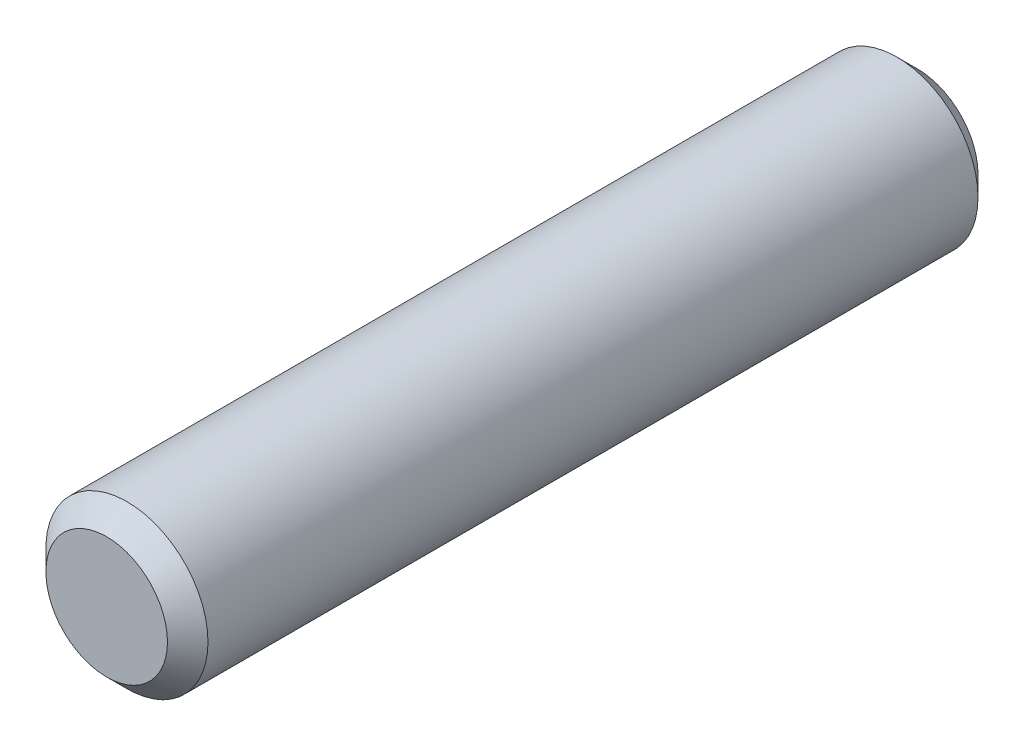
ISO-10303-21;
HEADER;
FILE_DESCRIPTION(('STEP AP214'),'2;1');
FILE_NAME('part.step','',(''),(''),'','','');
FILE_SCHEMA(('AUTOMOTIVE_DESIGN { 1 0 10303 214 1 1 1 1 }'));
ENDSEC;
DATA;
#1=APPLICATION_CONTEXT('core data for automotive mechanical design processes');
#2=APPLICATION_PROTOCOL_DEFINITION('international standard','automotive_design',2000,#1);
#3=PRODUCT_CONTEXT('',#1,'mechanical');
#4=PRODUCT('Part','Part','',(#3));
#5=PRODUCT_RELATED_PRODUCT_CATEGORY('part','',(#4));
#6=PRODUCT_DEFINITION_FORMATION('','',#4);
#7=PRODUCT_DEFINITION_CONTEXT('part definition',#1,'design');
#8=PRODUCT_DEFINITION('design','',#6,#7);
#9=PRODUCT_DEFINITION_SHAPE('','',#8);
#10=(LENGTH_UNIT() NAMED_UNIT(*) SI_UNIT(.MILLI.,.METRE.));
#11=(NAMED_UNIT(*) PLANE_ANGLE_UNIT() SI_UNIT($,.RADIAN.));
#12=(NAMED_UNIT(*) SI_UNIT($,.STERADIAN.) SOLID_ANGLE_UNIT());
#13=UNCERTAINTY_MEASURE_WITH_UNIT(LENGTH_MEASURE(1.E-05),#10,'distance_accuracy_value','');
#14=(GEOMETRIC_REPRESENTATION_CONTEXT(3) GLOBAL_UNCERTAINTY_ASSIGNED_CONTEXT((#13)) GLOBAL_UNIT_ASSIGNED_CONTEXT((#10,
#11,#12)) REPRESENTATION_CONTEXT('',''));
#15=CARTESIAN_POINT('',(0.,0.,0.));
#16=DIRECTION('',(0.,0.,1.));
#17=DIRECTION('',(1.,0.,0.));
#18=AXIS2_PLACEMENT_3D('',#15,#16,#17);
#19=CARTESIAN_POINT('',(0.,0.,40.));
#20=DIRECTION('',(0.,0.,-1.));
#21=DIRECTION('',(-1.,0.,0.));
#22=AXIS2_PLACEMENT_3D('',#19,#20,#21);
#23=CYLINDRICAL_SURFACE('',#22,4.);
#24=CARTESIAN_POINT('',(0.,0.,39.));
#25=DIRECTION('',(0.,0.,1.));
#26=DIRECTION('',(1.,0.,0.));
#27=AXIS2_PLACEMENT_3D('',#24,#25,#26);
#28=CIRCLE('',#27,4.);
#29=CARTESIAN_POINT('',(4.,0.,39.));
#30=VERTEX_POINT('',#29);
#31=EDGE_CURVE('E36',#30,#30,#28,.F.);
#32=ORIENTED_EDGE('',*,*,#31,.T.);
#33=EDGE_LOOP('',(#32));
#34=FACE_BOUND('',#33,.T.);
#35=CARTESIAN_POINT('',(0.,0.,1.00000000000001));
#36=DIRECTION('',(0.,0.,1.));
#37=DIRECTION('',(1.,0.,0.));
#38=AXIS2_PLACEMENT_3D('',#35,#36,#37);
#39=CIRCLE('',#38,4.);
#40=CARTESIAN_POINT('',(4.,0.,1.00000000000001));
#41=VERTEX_POINT('',#40);
#42=EDGE_CURVE('E40',#41,#41,#39,.T.);
#43=ORIENTED_EDGE('',*,*,#42,.T.);
#44=EDGE_LOOP('',(#43));
#45=FACE_BOUND('',#44,.T.);
#46=ADVANCED_FACE('F29',(#34,#45),#23,.T.);
#47=CARTESIAN_POINT('',(0.,0.,40.));
#48=DIRECTION('',(0.,0.,1.));
#49=DIRECTION('',(1.,0.,0.));
#50=AXIS2_PLACEMENT_3D('',#47,#48,#49);
#51=PLANE('',#50);
#52=CARTESIAN_POINT('',(0.,0.,40.));
#53=DIRECTION('',(0.,0.,1.));
#54=DIRECTION('',(1.,0.,0.));
#55=AXIS2_PLACEMENT_3D('',#52,#53,#54);
#56=CIRCLE('',#55,2.99999999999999);
#57=CARTESIAN_POINT('',(2.99999999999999,0.,40.));
#58=VERTEX_POINT('',#57);
#59=EDGE_CURVE('E44',#58,#58,#56,.T.);
#60=ORIENTED_EDGE('',*,*,#59,.T.);
#61=EDGE_LOOP('',(#60));
#62=FACE_BOUND('',#61,.T.);
#63=ADVANCED_FACE('F50',(#62),#51,.T.);
#64=CARTESIAN_POINT('',(0.,0.,0.));
#65=DIRECTION('',(0.,0.,1.));
#66=DIRECTION('',(1.,0.,0.));
#67=AXIS2_PLACEMENT_3D('',#64,#65,#66);
#68=PLANE('',#67);
#69=CARTESIAN_POINT('',(0.,0.,0.));
#70=DIRECTION('',(0.,0.,1.));
#71=DIRECTION('',(1.,0.,0.));
#72=AXIS2_PLACEMENT_3D('',#69,#70,#71);
#73=CIRCLE('',#72,2.99999999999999);
#74=CARTESIAN_POINT('',(2.99999999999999,0.,0.));
#75=VERTEX_POINT('',#74);
#76=EDGE_CURVE('E10',#75,#75,#73,.F.);
#77=ORIENTED_EDGE('',*,*,#76,.T.);
#78=EDGE_LOOP('',(#77));
#79=FACE_BOUND('',#78,.T.);
#80=ADVANCED_FACE('F54',(#79),#68,.F.);
#81=CARTESIAN_POINT('',(0.,0.,40.));
#82=DIRECTION('',(0.,0.,-1.));
#83=DIRECTION('',(-1.,0.,0.));
#84=AXIS2_PLACEMENT_3D('',#81,#82,#83);
#85=CONICAL_SURFACE('',#84,2.99999999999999,0.785398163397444);
#86=ORIENTED_EDGE('',*,*,#31,.F.);
#87=EDGE_LOOP('',(#86));
#88=FACE_BOUND('',#87,.T.);
#89=ORIENTED_EDGE('',*,*,#59,.F.);
#90=EDGE_LOOP('',(#89));
#91=FACE_BOUND('',#90,.T.);
#92=ADVANCED_FACE('F52',(#88,#91),#85,.T.);
#93=CARTESIAN_POINT('',(0.,0.,1.00000000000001));
#94=DIRECTION('',(0.,0.,1.));
#95=DIRECTION('',(1.,0.,0.));
#96=AXIS2_PLACEMENT_3D('',#93,#94,#95);
#97=CONICAL_SURFACE('',#96,4.,0.785398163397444);
#98=ORIENTED_EDGE('',*,*,#76,.F.);
#99=EDGE_LOOP('',(#98));
#100=FACE_BOUND('',#99,.T.);
#101=ORIENTED_EDGE('',*,*,#42,.F.);
#102=EDGE_LOOP('',(#101));
#103=FACE_BOUND('',#102,.T.);
#104=ADVANCED_FACE('F31',(#100,#103),#97,.T.);
#105=CLOSED_SHELL('',(#46,#63,#80,#92,#104));
#106=MANIFOLD_SOLID_BREP('B2',#105);
#107=ADVANCED_BREP_SHAPE_REPRESENTATION('',(#18,#106),#14);
#108=SHAPE_DEFINITION_REPRESENTATION(#9,#107);
ENDSEC;
END-ISO-10303-21;
